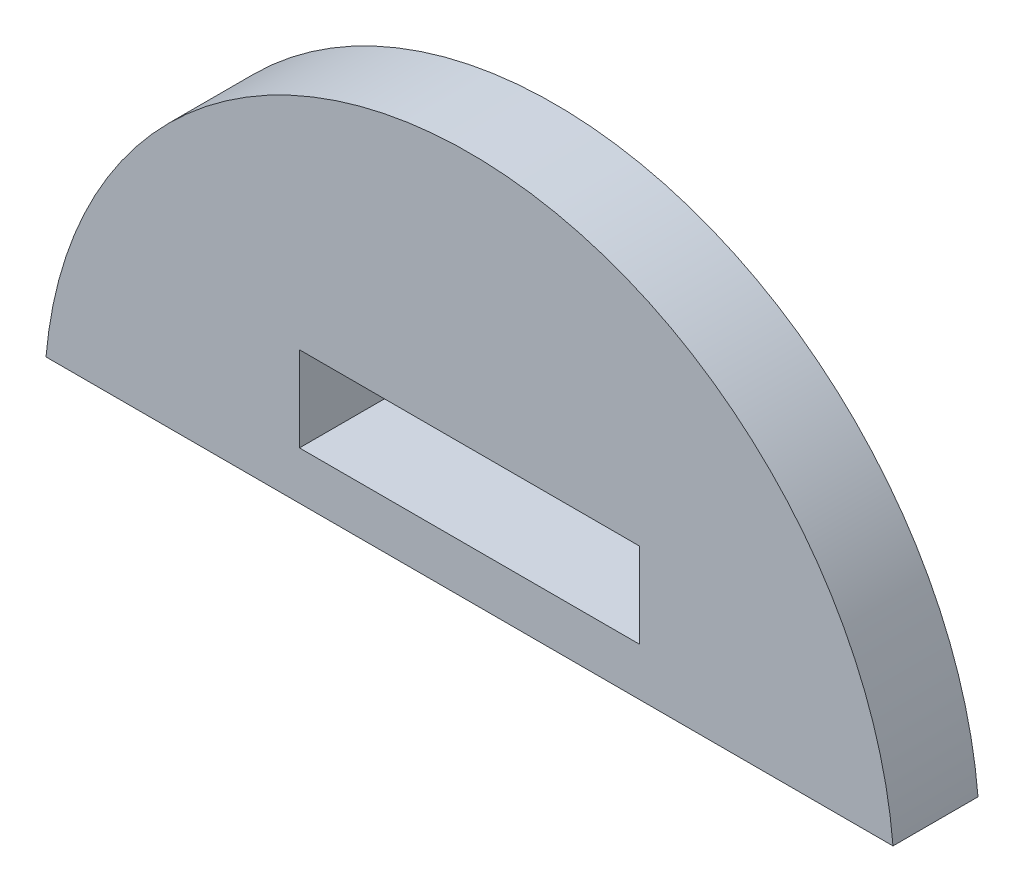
from build123d import *

# Parameters (mm, degrees)
SKETCH1_W      = 15.24
SKETCH1_H      = 3.81
EXTRUDE1_DEPTH = 3.81


with BuildPart() as part:
    # Sketch1 → Extrude1 (new body)
    with BuildSketch(Plane.XY):
        with BuildLine():
            Line((30.482982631, -0.964392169), (68.441484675, -0.964392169))
            ThreePointArc((68.441484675, -0.964392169), (49.462233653, 16.445324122), (30.482982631, -0.964392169))
        make_face()
        with Locations((49.462233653, 3.089133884)):
            Rectangle(SKETCH1_W, SKETCH1_H, mode=Mode.SUBTRACT)
    extrude(amount=EXTRUDE1_DEPTH)


solid = part.part
